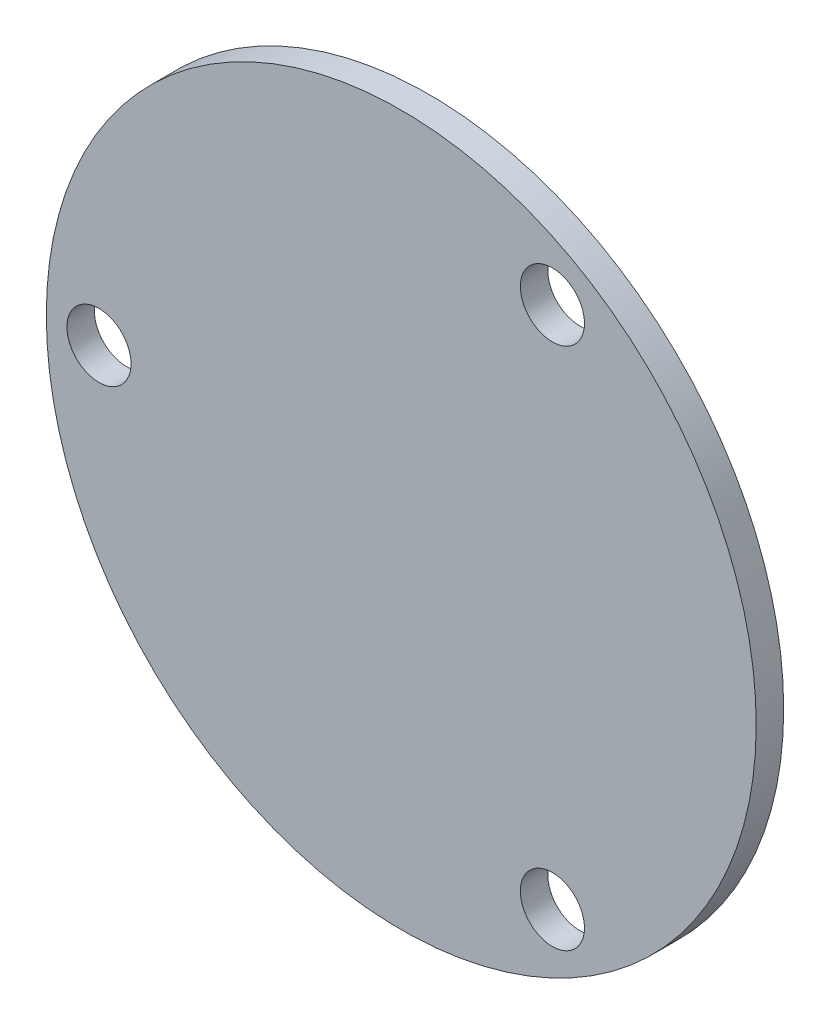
from build123d import *

# Parameters (mm, degrees)
ESQUISSE1_R        = 38.75
ESQUISSE1_R_2      = 3.5
BOSS_EXTRU_1_DEPTH = 3


with BuildPart() as part:
    # Esquisse1 → Boss.-Extru.1 (new body)
    with BuildSketch(Plane.XY):
        Circle(ESQUISSE1_R)
        with Locations((-33, 0)):
            Circle(ESQUISSE1_R_2, mode=Mode.SUBTRACT)
        with Locations((16.5, 28.578838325)):
            Circle(ESQUISSE1_R_2, mode=Mode.SUBTRACT)
        with Locations((16.5, -28.578838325)):
            Circle(ESQUISSE1_R_2, mode=Mode.SUBTRACT)
    extrude(amount=BOSS_EXTRU_1_DEPTH)


solid = part.part
